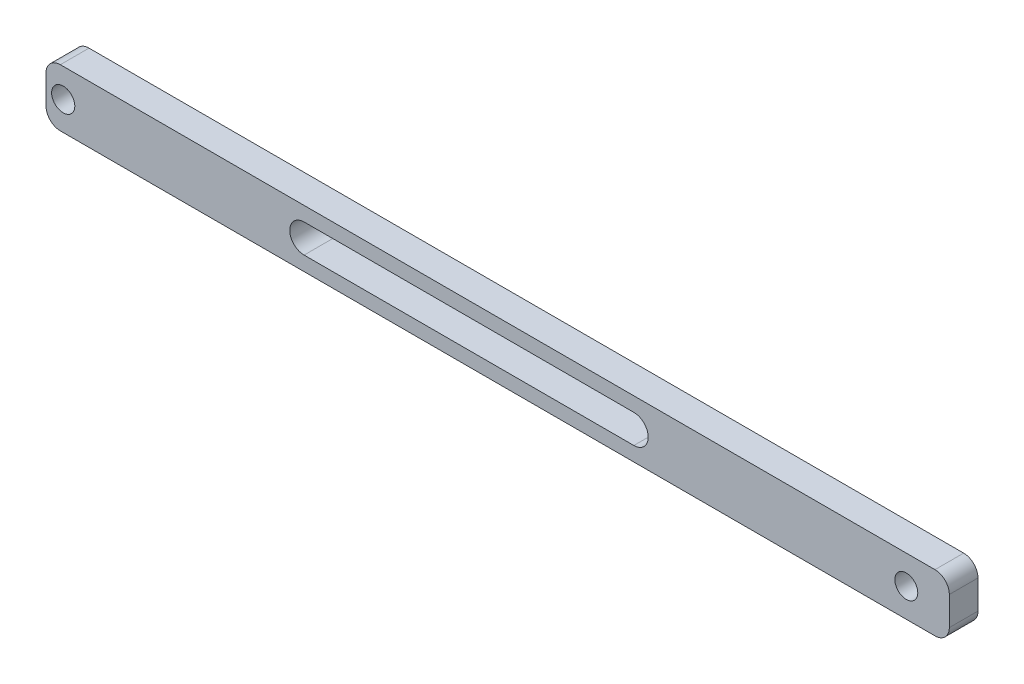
from build123d import *

# Parameters (mm, degrees)
EXTRUIR1_DEPTH        = 10
CROQUIS2_R            = 4
CORTAR_EXTRUIR1_DEPTH = 10
CROQUIS3_R            = 4.043614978
CORTAR_EXTRUIR2_DEPTH = 10


with BuildPart() as part:
    # Croquis1 → Extruir1 (new body)
    with BuildSketch(Plane.XY):
        with BuildLine():
            Line((-125, 10), (180, 10))
            ThreePointArc((180, 10), (183.535533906, 8.535533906), (185, 5))
            Line((185, 5), (185, -5))
            ThreePointArc((185, -5), (183.535533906, -8.535533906), (180, -10))
            Line((180, -10), (-125, -10))
            ThreePointArc((-125, -10), (-128.535533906, -8.535533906), (-130, -5))
            Line((-130, -5), (-130, 5))
            ThreePointArc((-130, 5), (-128.535533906, 8.535533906), (-125, 10))
        make_face()
    extrude(amount=EXTRUIR1_DEPTH)

    # Croquis2 → Cortar-Extruir1 (cut)
    with BuildSketch(Plane.XY.offset(10)):
        with Locations((170, 0)):
            Circle(CROQUIS2_R)
        with BuildLine():
            Line((-40, 5), (75, 5))
            ThreePointArc((75, 5), (80, 0), (75, -5))
            Line((75, -5), (-40, -5))
            ThreePointArc((-40, -5), (-45, 0), (-40, 5))
        make_face()
    extrude(amount=-CORTAR_EXTRUIR1_DEPTH, mode=Mode.SUBTRACT)

    # Croquis3 → Cortar-Extruir2 (cut)
    with BuildSketch(Plane.XY.offset(10)):
        with Locations((-124, 0)):
            Circle(CROQUIS3_R)
    extrude(amount=-CORTAR_EXTRUIR2_DEPTH, mode=Mode.SUBTRACT)


solid = part.part
